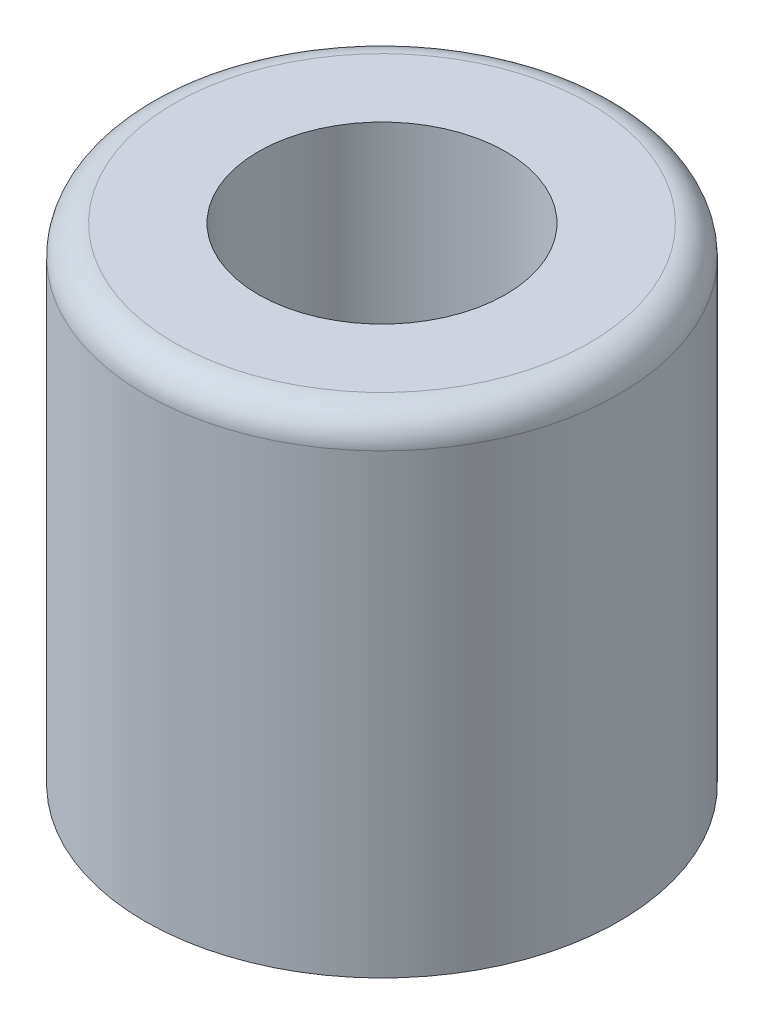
from build123d import *

# Parameters (mm, degrees)
SKETCH1_R      = 4.064
SKETCH1_R_2    = 2.1209
EXTRUDE1_DEPTH = 4.1656
FILLET1_R      = 0.508


with BuildPart() as part:
    # Sketch1 → Extrude1 (new, symmetric)
    with BuildSketch(Plane(origin=(0, 0, 0), x_dir=(1, 0, 0), z_dir=(0, 1, 0))):
        with Locations(Location((0, 0, 0), (0, 0, 270))):
            Circle(SKETCH1_R)
        with Locations(Location((0, 0, 0), (0, 0, 270))):
            Circle(SKETCH1_R_2, mode=Mode.SUBTRACT)
    extrude(amount=EXTRUDE1_DEPTH, both=True)

    # Fillet1
    fillet1_edges = [part.edges().sort_by_distance(p)[0] for p in [
        (0, 4.1656, -4.064),
    ]]
    fillet(fillet1_edges, radius=FILLET1_R)


solid = part.part
